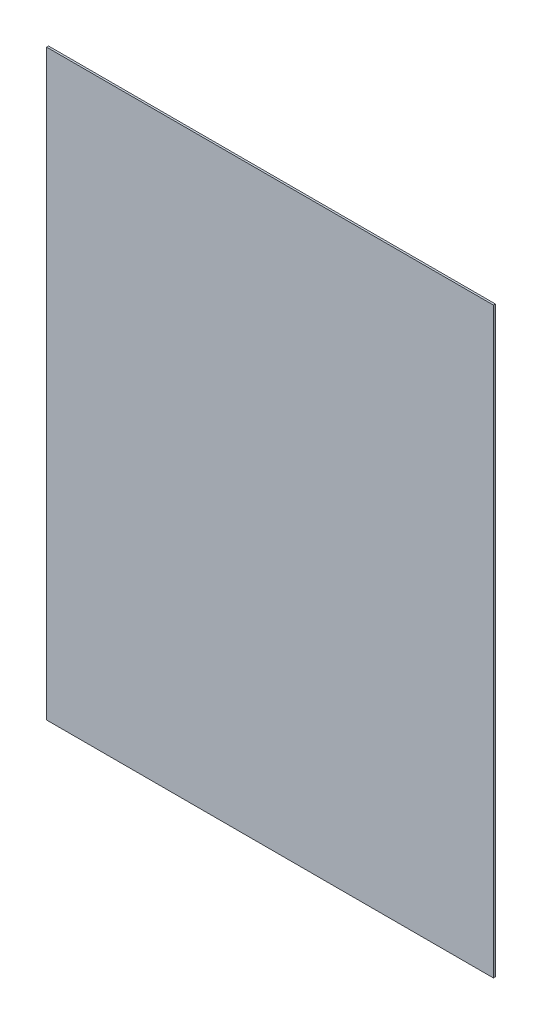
ISO-10303-21;
HEADER;
FILE_DESCRIPTION(('STEP AP214'),'2;1');
FILE_NAME('part.step','',(''),(''),'','','');
FILE_SCHEMA(('AUTOMOTIVE_DESIGN { 1 0 10303 214 1 1 1 1 }'));
ENDSEC;
DATA;
#1=APPLICATION_CONTEXT('core data for automotive mechanical design processes');
#2=APPLICATION_PROTOCOL_DEFINITION('international standard','automotive_design',2000,#1);
#3=PRODUCT_CONTEXT('',#1,'mechanical');
#4=PRODUCT('Part','Part','',(#3));
#5=PRODUCT_RELATED_PRODUCT_CATEGORY('part','',(#4));
#6=PRODUCT_DEFINITION_FORMATION('','',#4);
#7=PRODUCT_DEFINITION_CONTEXT('part definition',#1,'design');
#8=PRODUCT_DEFINITION('design','',#6,#7);
#9=PRODUCT_DEFINITION_SHAPE('','',#8);
#10=(LENGTH_UNIT() NAMED_UNIT(*) SI_UNIT(.MILLI.,.METRE.));
#11=(NAMED_UNIT(*) PLANE_ANGLE_UNIT() SI_UNIT($,.RADIAN.));
#12=(NAMED_UNIT(*) SI_UNIT($,.STERADIAN.) SOLID_ANGLE_UNIT());
#13=UNCERTAINTY_MEASURE_WITH_UNIT(LENGTH_MEASURE(1.E-05),#10,'distance_accuracy_value','');
#14=(GEOMETRIC_REPRESENTATION_CONTEXT(3) GLOBAL_UNCERTAINTY_ASSIGNED_CONTEXT((#13)) GLOBAL_UNIT_ASSIGNED_CONTEXT((#10,
#11,#12)) REPRESENTATION_CONTEXT('',''));
#15=CARTESIAN_POINT('',(0.,0.,0.));
#16=DIRECTION('',(0.,0.,1.));
#17=DIRECTION('',(1.,0.,0.));
#18=AXIS2_PLACEMENT_3D('',#15,#16,#17);
#19=CARTESIAN_POINT('',(-1360.61684850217,40.0222789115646,10.));
#20=DIRECTION('',(1.,0.,0.));
#21=DIRECTION('',(0.,1.,0.));
#22=AXIS2_PLACEMENT_3D('',#19,#20,#21);
#23=PLANE('',#22);
#24=DIRECTION('',(0.,-1.,0.));
#25=VECTOR('',#24,1.);
#26=CARTESIAN_POINT('',(-1360.61684850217,40.0222789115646,0.));
#27=LINE('',#26,#25);
#28=CARTESIAN_POINT('',(-1360.61684850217,40.0222789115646,0.));
#29=VERTEX_POINT('',#28);
#30=CARTESIAN_POINT('',(-1360.61684850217,-2959.97772108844,0.));
#31=VERTEX_POINT('',#30);
#32=EDGE_CURVE('E96',#29,#31,#27,.T.);
#33=ORIENTED_EDGE('',*,*,#32,.T.);
#34=DIRECTION('',(0.,0.,-1.));
#35=VECTOR('',#34,1.);
#36=CARTESIAN_POINT('',(-1360.61684850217,-2959.97772108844,10.));
#37=LINE('',#36,#35);
#38=CARTESIAN_POINT('',(-1360.61684850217,-2959.97772108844,10.));
#39=VERTEX_POINT('',#38);
#40=EDGE_CURVE('E11',#39,#31,#37,.T.);
#41=ORIENTED_EDGE('',*,*,#40,.F.);
#42=DIRECTION('',(0.,-1.,0.));
#43=VECTOR('',#42,1.);
#44=CARTESIAN_POINT('',(-1360.61684850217,40.0222789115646,10.));
#45=LINE('',#44,#43);
#46=CARTESIAN_POINT('',(-1360.61684850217,40.0222789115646,10.));
#47=VERTEX_POINT('',#46);
#48=EDGE_CURVE('E84',#47,#39,#45,.T.);
#49=ORIENTED_EDGE('',*,*,#48,.F.);
#50=DIRECTION('',(0.,0.,-1.));
#51=VECTOR('',#50,1.);
#52=CARTESIAN_POINT('',(-1360.61684850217,40.0222789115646,10.));
#53=LINE('',#52,#51);
#54=EDGE_CURVE('E92',#47,#29,#53,.T.);
#55=ORIENTED_EDGE('',*,*,#54,.T.);
#56=EDGE_LOOP('',(#33,#41,#49,#55));
#57=FACE_BOUND('',#56,.T.);
#58=ADVANCED_FACE('F33',(#57),#23,.F.);
#59=CARTESIAN_POINT('',(-1360.61684850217,-2959.97772108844,10.));
#60=DIRECTION('',(0.,1.,0.));
#61=DIRECTION('',(0.,0.,1.));
#62=AXIS2_PLACEMENT_3D('',#59,#60,#61);
#63=PLANE('',#62);
#64=DIRECTION('',(1.,0.,0.));
#65=VECTOR('',#64,1.);
#66=CARTESIAN_POINT('',(-1360.61684850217,-2959.97772108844,0.));
#67=LINE('',#66,#65);
#68=CARTESIAN_POINT('',(939.383151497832,-2959.97772108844,0.));
#69=VERTEX_POINT('',#68);
#70=EDGE_CURVE('E88',#31,#69,#67,.T.);
#71=ORIENTED_EDGE('',*,*,#70,.T.);
#72=DIRECTION('',(0.,0.,-1.));
#73=VECTOR('',#72,1.);
#74=CARTESIAN_POINT('',(939.383151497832,-2959.97772108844,10.));
#75=LINE('',#74,#73);
#76=CARTESIAN_POINT('',(939.383151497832,-2959.97772108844,10.));
#77=VERTEX_POINT('',#76);
#78=EDGE_CURVE('E41',#77,#69,#75,.T.);
#79=ORIENTED_EDGE('',*,*,#78,.F.);
#80=DIRECTION('',(1.,0.,0.));
#81=VECTOR('',#80,1.);
#82=CARTESIAN_POINT('',(-1360.61684850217,-2959.97772108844,10.));
#83=LINE('',#82,#81);
#84=EDGE_CURVE('E79',#39,#77,#83,.T.);
#85=ORIENTED_EDGE('',*,*,#84,.F.);
#86=ORIENTED_EDGE('',*,*,#40,.T.);
#87=EDGE_LOOP('',(#71,#79,#85,#86));
#88=FACE_BOUND('',#87,.T.);
#89=ADVANCED_FACE('F87',(#88),#63,.F.);
#90=CARTESIAN_POINT('',(939.383151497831,40.0222789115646,10.));
#91=DIRECTION('',(-1.,0.,0.));
#92=DIRECTION('',(0.,-1.,0.));
#93=AXIS2_PLACEMENT_3D('',#90,#91,#92);
#94=PLANE('',#93);
#95=DIRECTION('',(0.,1.,0.));
#96=VECTOR('',#95,1.);
#97=CARTESIAN_POINT('',(939.383151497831,40.0222789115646,0.));
#98=LINE('',#97,#96);
#99=CARTESIAN_POINT('',(939.383151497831,40.0222789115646,0.));
#100=VERTEX_POINT('',#99);
#101=EDGE_CURVE('E66',#69,#100,#98,.T.);
#102=ORIENTED_EDGE('',*,*,#101,.T.);
#103=DIRECTION('',(0.,0.,-1.));
#104=VECTOR('',#103,1.);
#105=CARTESIAN_POINT('',(939.383151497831,40.0222789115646,10.));
#106=LINE('',#105,#104);
#107=CARTESIAN_POINT('',(939.383151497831,40.0222789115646,10.));
#108=VERTEX_POINT('',#107);
#109=EDGE_CURVE('E89',#108,#100,#106,.T.);
#110=ORIENTED_EDGE('',*,*,#109,.F.);
#111=DIRECTION('',(0.,1.,0.));
#112=VECTOR('',#111,1.);
#113=CARTESIAN_POINT('',(939.383151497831,40.0222789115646,10.));
#114=LINE('',#113,#112);
#115=EDGE_CURVE('E82',#77,#108,#114,.T.);
#116=ORIENTED_EDGE('',*,*,#115,.F.);
#117=ORIENTED_EDGE('',*,*,#78,.T.);
#118=EDGE_LOOP('',(#102,#110,#116,#117));
#119=FACE_BOUND('',#118,.T.);
#120=ADVANCED_FACE('F90',(#119),#94,.F.);
#121=CARTESIAN_POINT('',(-1360.61684850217,40.0222789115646,10.));
#122=DIRECTION('',(0.,-1.,0.));
#123=DIRECTION('',(0.,0.,-1.));
#124=AXIS2_PLACEMENT_3D('',#121,#122,#123);
#125=PLANE('',#124);
#126=DIRECTION('',(-1.,0.,0.));
#127=VECTOR('',#126,1.);
#128=CARTESIAN_POINT('',(-1360.61684850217,40.0222789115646,0.));
#129=LINE('',#128,#127);
#130=EDGE_CURVE('E72',#100,#29,#129,.T.);
#131=ORIENTED_EDGE('',*,*,#130,.T.);
#132=ORIENTED_EDGE('',*,*,#54,.F.);
#133=DIRECTION('',(-1.,0.,0.));
#134=VECTOR('',#133,1.);
#135=CARTESIAN_POINT('',(-1360.61684850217,40.0222789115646,10.));
#136=LINE('',#135,#134);
#137=EDGE_CURVE('E49',#108,#47,#136,.T.);
#138=ORIENTED_EDGE('',*,*,#137,.F.);
#139=ORIENTED_EDGE('',*,*,#109,.T.);
#140=EDGE_LOOP('',(#131,#132,#138,#139));
#141=FACE_BOUND('',#140,.T.);
#142=ADVANCED_FACE('F103',(#141),#125,.F.);
#143=CARTESIAN_POINT('',(0.,0.,10.));
#144=DIRECTION('',(0.,0.,1.));
#145=DIRECTION('',(1.,0.,0.));
#146=AXIS2_PLACEMENT_3D('',#143,#144,#145);
#147=PLANE('',#146);
#148=ORIENTED_EDGE('',*,*,#48,.T.);
#149=ORIENTED_EDGE('',*,*,#84,.T.);
#150=ORIENTED_EDGE('',*,*,#115,.T.);
#151=ORIENTED_EDGE('',*,*,#137,.T.);
#152=EDGE_LOOP('',(#148,#149,#150,#151));
#153=FACE_BOUND('',#152,.T.);
#154=ADVANCED_FACE('F80',(#153),#147,.T.);
#155=CARTESIAN_POINT('',(0.,0.,0.));
#156=DIRECTION('',(0.,0.,1.));
#157=DIRECTION('',(1.,0.,0.));
#158=AXIS2_PLACEMENT_3D('',#155,#156,#157);
#159=PLANE('',#158);
#160=ORIENTED_EDGE('',*,*,#32,.F.);
#161=ORIENTED_EDGE('',*,*,#130,.F.);
#162=ORIENTED_EDGE('',*,*,#101,.F.);
#163=ORIENTED_EDGE('',*,*,#70,.F.);
#164=EDGE_LOOP('',(#160,#161,#162,#163));
#165=FACE_BOUND('',#164,.T.);
#166=ADVANCED_FACE('F106',(#165),#159,.F.);
#167=CLOSED_SHELL('',(#58,#89,#120,#142,#154,#166));
#168=MANIFOLD_SOLID_BREP('B2',#167);
#169=ADVANCED_BREP_SHAPE_REPRESENTATION('',(#18,#168),#14);
#170=SHAPE_DEFINITION_REPRESENTATION(#9,#169);
ENDSEC;
END-ISO-10303-21;
